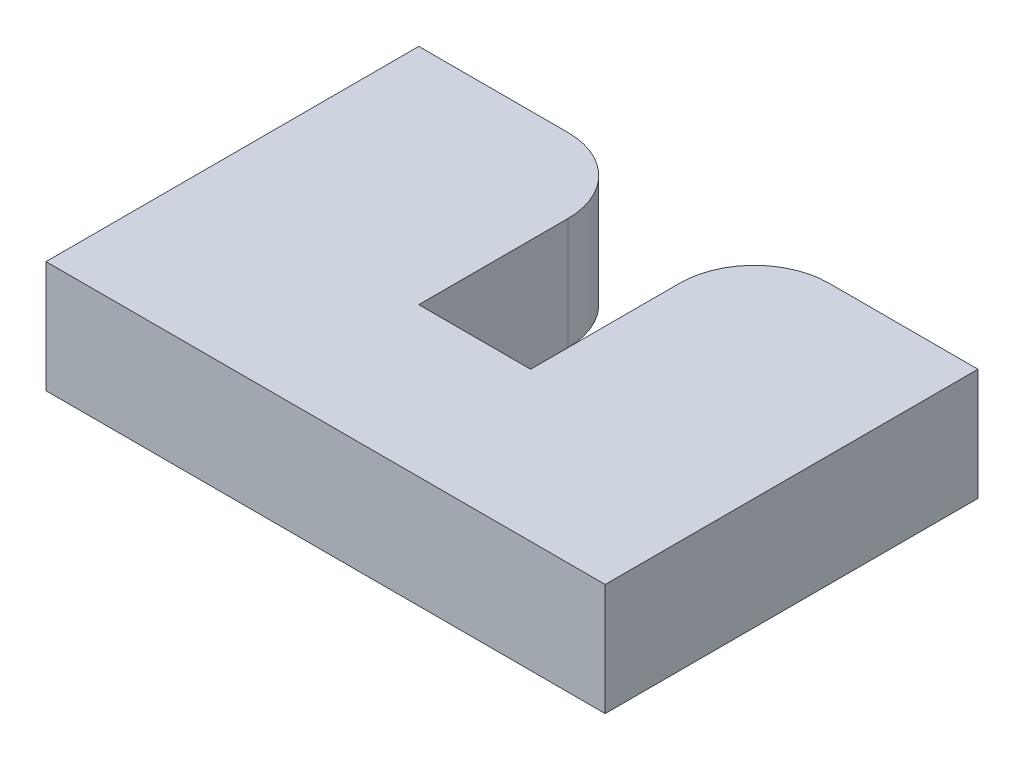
from build123d import *

# Parameters (mm, degrees)
BOSS_EXTRUDE1_DEPTH = 15


with BuildPart() as part:
    # Sketch1 → Boss-Extrude1 (new body)
    with BuildSketch(Plane(origin=(0, 0, 0), x_dir=(1, 0, 0), z_dir=(0, 1, 0))):
        with BuildLine():
            Line((30, 40), (30, 20))
            Line((30, 20), (45, 20))
            Line((45, 20), (45, 40))
            ThreePointArc((45, 40), (47.928932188, 47.071067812), (55, 50))
            Line((55, 50), (75, 50))
            Line((75, 50), (75, 0))
            Line((75, 0), (0, 0))
            Line((0, 0), (0, 50))
            Line((0, 50), (20, 50))
            ThreePointArc((20, 50), (27.071067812, 47.071067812), (30, 40))
        make_face()
    extrude(amount=BOSS_EXTRUDE1_DEPTH)


solid = part.part
